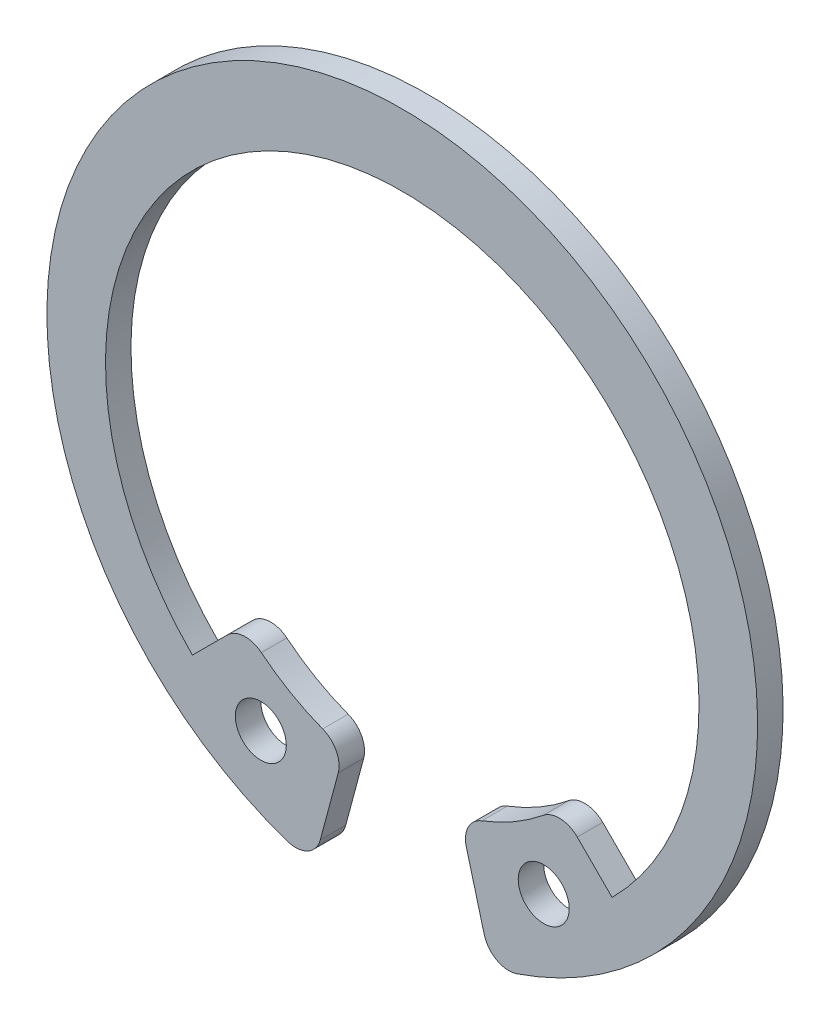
from build123d import *

# Parameters (mm, degrees)
ESQUISSE1_R          = 1
BASE_EXTRUSION_DEPTH = 1


with BuildPart() as part:
    # Esquisse1 → Base-Extrusion (new body)
    with BuildSketch(Plane.XY):
        with BuildLine():
            Line((3.219124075, -12.013934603), (2.514454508, -9.384071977))
            ThreePointArc((2.514454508, -9.384071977), (2.589862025, -8.670305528), (3.124019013, -8.190904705))
            ThreePointArc((3.124019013, -8.190904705), (4.383218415, -7.591956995), (5.531522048, -6.80093218))
            ThreePointArc((5.531522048, -6.80093218), (6.213773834, -6.57803907), (6.869617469, -6.869617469))
            Line((6.869617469, -6.869617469), (8.237794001, -8.237794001))
            ThreePointArc((8.237794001, -8.237794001), (0, 11.65), (-8.237794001, -8.237794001))
            Line((-8.237794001, -8.237794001), (-6.869617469, -6.869617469))
            ThreePointArc((-6.869617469, -6.869617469), (-6.213773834, -6.57803907), (-5.531522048, -6.80093218))
            ThreePointArc((-5.531522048, -6.80093218), (-4.383218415, -7.591956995), (-3.124019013, -8.190904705))
            ThreePointArc((-3.124019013, -8.190904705), (-2.589862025, -8.670305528), (-2.514454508, -9.384071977))
            Line((-2.514454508, -9.384071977), (-3.219124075, -12.013934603))
            ThreePointArc((-3.219124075, -12.013934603), (-3.714459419, -12.6374673), (-4.508219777, -12.701456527))
            ThreePointArc((-4.508219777, -12.701456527), (0, 14.45), (4.508219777, -12.701456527))
            ThreePointArc((4.508219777, -12.701456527), (3.714459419, -12.6374673), (3.219124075, -12.013934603))
        make_face()
        with Locations((-5.552291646, -9.468398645)):
            Circle(ESQUISSE1_R, mode=Mode.SUBTRACT)
        with Locations(Location((5.552291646, -9.468398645, 0), (0, 0, 180))):
            Circle(ESQUISSE1_R, mode=Mode.SUBTRACT)
    extrude(amount=BASE_EXTRUSION_DEPTH)


solid = part.part
